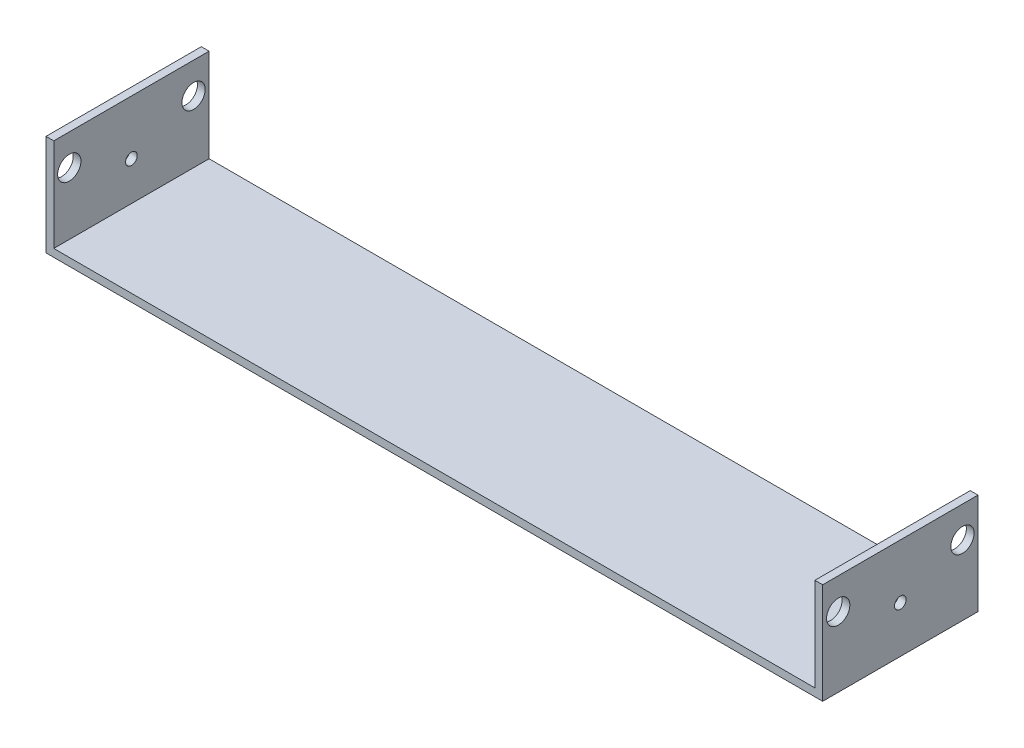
from build123d import *

# Parameters (mm, degrees)
SKETCH1_W          = 635
SKETCH1_H          = 127
EXTRUDE1_DEPTH     = 6.35
SKETCH2_W          = 6.35
SKETCH2_H          = 127
EXTRUDE2_DEPTH     = 76.2
SKETCH3_R          = 9.525
CUT_EXTRUDE1_DEPTH = 645.81260743
SKETCH4_R          = 4.7625
CUT_EXTRUDE2_DEPTH = 645.81260743


with BuildPart() as part:
    # Sketch1 → Extrude1 (new body)
    with BuildSketch(Plane(origin=(0, 0, 0), x_dir=(1, 0, 0), z_dir=(0, 1, 0))):
        with Locations((257.066810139, -12.287836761)):
            Rectangle(SKETCH1_W, SKETCH1_H)
    extrude(amount=EXTRUDE1_DEPTH)

    # Sketch2 → Extrude2 (add)
    with BuildSketch(Plane(origin=(0, 6.35, 0), x_dir=(-1, 0, 0), z_dir=(0, 1, 0))):
        with Locations((-571.391810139, 12.287836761)):
            Rectangle(SKETCH2_W, SKETCH2_H)
        with Locations((57.258189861, 12.287836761)):
            Rectangle(SKETCH2_W, SKETCH2_H)
    extrude(amount=EXTRUDE2_DEPTH)

    # Sketch3 → Cut-Extrude1 (cut, through all)
    with BuildSketch(Plane.ZY.offset(60.433189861)):
        with Locations((-38.512163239, 57.15)):
            Circle(SKETCH3_R)
        with Locations((63.087836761, 57.15)):
            Circle(SKETCH3_R)
    extrude(amount=-CUT_EXTRUDE1_DEPTH, mode=Mode.SUBTRACT)

    # Sketch4 → Cut-Extrude2 (cut, through all)
    with BuildSketch(Plane.ZY.offset(60.433189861)):
        with Locations((12.287836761, 38.1)):
            Circle(SKETCH4_R)
    extrude(amount=-CUT_EXTRUDE2_DEPTH, mode=Mode.SUBTRACT)


solid = part.part
